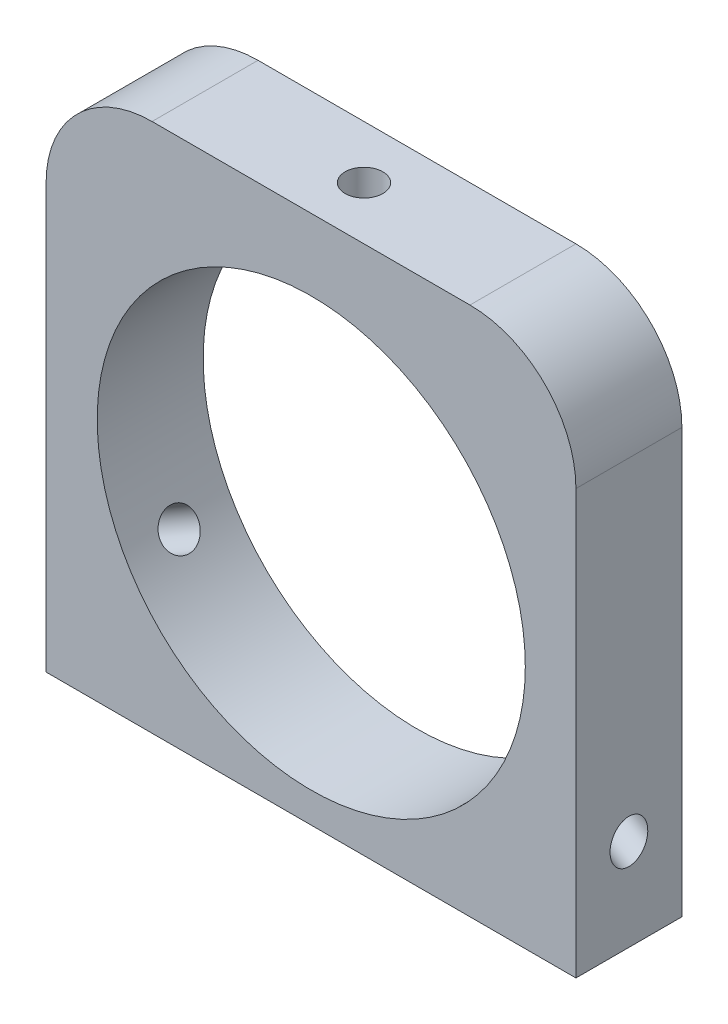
ISO-10303-21;
HEADER;
FILE_DESCRIPTION(('STEP AP214'),'2;1');
FILE_NAME('part.step','',(''),(''),'','','');
FILE_SCHEMA(('AUTOMOTIVE_DESIGN { 1 0 10303 214 1 1 1 1 }'));
ENDSEC;
DATA;
#1=APPLICATION_CONTEXT('core data for automotive mechanical design processes');
#2=APPLICATION_PROTOCOL_DEFINITION('international standard','automotive_design',2000,#1);
#3=PRODUCT_CONTEXT('',#1,'mechanical');
#4=PRODUCT('Part','Part','',(#3));
#5=PRODUCT_RELATED_PRODUCT_CATEGORY('part','',(#4));
#6=PRODUCT_DEFINITION_FORMATION('','',#4);
#7=PRODUCT_DEFINITION_CONTEXT('part definition',#1,'design');
#8=PRODUCT_DEFINITION('design','',#6,#7);
#9=PRODUCT_DEFINITION_SHAPE('','',#8);
#10=(LENGTH_UNIT() NAMED_UNIT(*) SI_UNIT(.MILLI.,.METRE.));
#11=(NAMED_UNIT(*) PLANE_ANGLE_UNIT() SI_UNIT($,.RADIAN.));
#12=(NAMED_UNIT(*) SI_UNIT($,.STERADIAN.) SOLID_ANGLE_UNIT());
#13=UNCERTAINTY_MEASURE_WITH_UNIT(LENGTH_MEASURE(1.E-05),#10,'distance_accuracy_value','');
#14=(GEOMETRIC_REPRESENTATION_CONTEXT(3) GLOBAL_UNCERTAINTY_ASSIGNED_CONTEXT((#13)) GLOBAL_UNIT_ASSIGNED_CONTEXT((#10,
#11,#12)) REPRESENTATION_CONTEXT('',''));
#15=CARTESIAN_POINT('',(0.,0.,0.));
#16=DIRECTION('',(0.,0.,1.));
#17=DIRECTION('',(1.,0.,0.));
#18=AXIS2_PLACEMENT_3D('',#15,#16,#17);
#19=CARTESIAN_POINT('',(15.875,31.75,-3.175));
#20=DIRECTION('',(-1.,0.,0.));
#21=DIRECTION('',(0.,0.,1.));
#22=AXIS2_PLACEMENT_3D('',#19,#20,#21);
#23=PLANE('',#22);
#24=CARTESIAN_POINT('',(15.875,5.49918608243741,0.));
#25=DIRECTION('',(-1.,0.,0.));
#26=DIRECTION('',(0.,-1.,0.));
#27=AXIS2_PLACEMENT_3D('',#24,#25,#26);
#28=ELLIPSE('',#27,1.30515801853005,1.13029999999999);
#29=CARTESIAN_POINT('',(15.875,4.19402806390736,0.));
#30=VERTEX_POINT('',#29);
#31=EDGE_CURVE('E465',#30,#30,#28,.T.);
#32=ORIENTED_EDGE('',*,*,#31,.T.);
#33=EDGE_LOOP('',(#32));
#34=FACE_BOUND('',#33,.T.);
#35=DIRECTION('',(0.,-1.,0.));
#36=VECTOR('',#35,1.);
#37=CARTESIAN_POINT('',(15.875,31.75,-3.175));
#38=LINE('',#37,#36);
#39=CARTESIAN_POINT('',(15.875,25.4,-3.175));
#40=VERTEX_POINT('',#39);
#41=CARTESIAN_POINT('',(15.875,0.,-3.175));
#42=VERTEX_POINT('',#41);
#43=EDGE_CURVE('E168',#40,#42,#38,.T.);
#44=ORIENTED_EDGE('',*,*,#43,.F.);
#45=DIRECTION('',(0.,0.,-1.));
#46=VECTOR('',#45,1.);
#47=CARTESIAN_POINT('',(15.875,25.4,3.175));
#48=LINE('',#47,#46);
#49=CARTESIAN_POINT('',(15.875,25.4,3.175));
#50=VERTEX_POINT('',#49);
#51=EDGE_CURVE('E11',#40,#50,#48,.F.);
#52=ORIENTED_EDGE('',*,*,#51,.T.);
#53=DIRECTION('',(0.,-1.,0.));
#54=VECTOR('',#53,1.);
#55=CARTESIAN_POINT('',(15.875,31.75,3.175));
#56=LINE('',#55,#54);
#57=CARTESIAN_POINT('',(15.875,0.,3.175));
#58=VERTEX_POINT('',#57);
#59=EDGE_CURVE('E145',#50,#58,#56,.T.);
#60=ORIENTED_EDGE('',*,*,#59,.T.);
#61=DIRECTION('',(0.,0.,-1.));
#62=VECTOR('',#61,1.);
#63=CARTESIAN_POINT('',(15.875,0.,-3.175));
#64=LINE('',#63,#62);
#65=EDGE_CURVE('E135',#58,#42,#64,.T.);
#66=ORIENTED_EDGE('',*,*,#65,.T.);
#67=EDGE_LOOP('',(#44,#52,#60,#66));
#68=FACE_BOUND('',#67,.T.);
#69=ADVANCED_FACE('F42',(#34,#68),#23,.F.);
#70=CARTESIAN_POINT('',(-15.875,31.75,-3.175));
#71=DIRECTION('',(0.,0.,1.));
#72=DIRECTION('',(1.,0.,0.));
#73=AXIS2_PLACEMENT_3D('',#70,#71,#72);
#74=PLANE('',#73);
#75=CARTESIAN_POINT('',(0.0144886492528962,14.6395265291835,-3.175));
#76=DIRECTION('',(0.,0.,1.));
#77=DIRECTION('',(1.,0.,0.));
#78=AXIS2_PLACEMENT_3D('',#75,#76,#77);
#79=CIRCLE('',#78,12.827);
#80=CARTESIAN_POINT('',(12.8414886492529,14.6395265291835,-3.175));
#81=VERTEX_POINT('',#80);
#82=EDGE_CURVE('E128',#81,#81,#79,.T.);
#83=ORIENTED_EDGE('',*,*,#82,.T.);
#84=EDGE_LOOP('',(#83));
#85=FACE_BOUND('',#84,.T.);
#86=DIRECTION('',(0.,-1.,0.));
#87=VECTOR('',#86,1.);
#88=CARTESIAN_POINT('',(-15.875,31.75,-3.175));
#89=LINE('',#88,#87);
#90=CARTESIAN_POINT('',(-15.875,25.4,-3.175));
#91=VERTEX_POINT('',#90);
#92=CARTESIAN_POINT('',(-15.875,0.,-3.175));
#93=VERTEX_POINT('',#92);
#94=EDGE_CURVE('E165',#91,#93,#89,.T.);
#95=ORIENTED_EDGE('',*,*,#94,.F.);
#96=CARTESIAN_POINT('',(-9.525,25.4,-3.175));
#97=DIRECTION('',(0.,0.,1.));
#98=DIRECTION('',(1.,0.,0.));
#99=AXIS2_PLACEMENT_3D('',#96,#97,#98);
#100=CIRCLE('',#99,6.35);
#101=CARTESIAN_POINT('',(-9.525,31.75,-3.175));
#102=VERTEX_POINT('',#101);
#103=EDGE_CURVE('E57',#91,#102,#100,.F.);
#104=ORIENTED_EDGE('',*,*,#103,.T.);
#105=DIRECTION('',(-1.,0.,0.));
#106=VECTOR('',#105,1.);
#107=CARTESIAN_POINT('',(-15.875,31.75,-3.175));
#108=LINE('',#107,#106);
#109=CARTESIAN_POINT('',(9.525,31.75,-3.175));
#110=VERTEX_POINT('',#109);
#111=EDGE_CURVE('E136',#110,#102,#108,.T.);
#112=ORIENTED_EDGE('',*,*,#111,.F.);
#113=CARTESIAN_POINT('',(9.525,25.4,-3.175));
#114=DIRECTION('',(0.,0.,1.));
#115=DIRECTION('',(1.,0.,0.));
#116=AXIS2_PLACEMENT_3D('',#113,#114,#115);
#117=CIRCLE('',#116,6.35);
#118=EDGE_CURVE('E65',#110,#40,#117,.F.);
#119=ORIENTED_EDGE('',*,*,#118,.T.);
#120=ORIENTED_EDGE('',*,*,#43,.T.);
#121=DIRECTION('',(-1.,0.,0.));
#122=VECTOR('',#121,1.);
#123=CARTESIAN_POINT('',(-15.875,0.,-3.175));
#124=LINE('',#123,#122);
#125=EDGE_CURVE('E149',#42,#93,#124,.T.);
#126=ORIENTED_EDGE('',*,*,#125,.T.);
#127=EDGE_LOOP('',(#95,#104,#112,#119,#120,#126));
#128=FACE_BOUND('',#127,.T.);
#129=ADVANCED_FACE('F225',(#85,#128),#74,.F.);
#130=CARTESIAN_POINT('',(-15.875,31.75,-3.175));
#131=DIRECTION('',(1.,0.,0.));
#132=DIRECTION('',(0.,0.,-1.));
#133=AXIS2_PLACEMENT_3D('',#130,#131,#132);
#134=PLANE('',#133);
#135=CARTESIAN_POINT('',(-15.875,5.44899592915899,0.));
#136=DIRECTION('',(1.,0.,0.));
#137=DIRECTION('',(0.,-1.,0.));
#138=AXIS2_PLACEMENT_3D('',#135,#136,#137);
#139=ELLIPSE('',#138,1.30515801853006,1.13029999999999);
#140=CARTESIAN_POINT('',(-15.875,4.14383791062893,0.));
#141=VERTEX_POINT('',#140);
#142=EDGE_CURVE('E199',#141,#141,#139,.T.);
#143=ORIENTED_EDGE('',*,*,#142,.T.);
#144=EDGE_LOOP('',(#143));
#145=FACE_BOUND('',#144,.T.);
#146=DIRECTION('',(0.,-1.,0.));
#147=VECTOR('',#146,1.);
#148=CARTESIAN_POINT('',(-15.875,31.75,3.175));
#149=LINE('',#148,#147);
#150=CARTESIAN_POINT('',(-15.875,25.4,3.175));
#151=VERTEX_POINT('',#150);
#152=CARTESIAN_POINT('',(-15.875,0.,3.175));
#153=VERTEX_POINT('',#152);
#154=EDGE_CURVE('E162',#151,#153,#149,.T.);
#155=ORIENTED_EDGE('',*,*,#154,.F.);
#156=DIRECTION('',(0.,0.,1.));
#157=VECTOR('',#156,1.);
#158=CARTESIAN_POINT('',(-15.875,25.4,-3.175));
#159=LINE('',#158,#157);
#160=EDGE_CURVE('E73',#151,#91,#159,.F.);
#161=ORIENTED_EDGE('',*,*,#160,.T.);
#162=ORIENTED_EDGE('',*,*,#94,.T.);
#163=DIRECTION('',(0.,0.,1.));
#164=VECTOR('',#163,1.);
#165=CARTESIAN_POINT('',(-15.875,0.,-3.175));
#166=LINE('',#165,#164);
#167=EDGE_CURVE('E153',#93,#153,#166,.T.);
#168=ORIENTED_EDGE('',*,*,#167,.T.);
#169=EDGE_LOOP('',(#155,#161,#162,#168));
#170=FACE_BOUND('',#169,.T.);
#171=ADVANCED_FACE('F231',(#145,#170),#134,.F.);
#172=CARTESIAN_POINT('',(-15.875,31.75,3.175));
#173=DIRECTION('',(0.,0.,-1.));
#174=DIRECTION('',(-1.,0.,0.));
#175=AXIS2_PLACEMENT_3D('',#172,#173,#174);
#176=PLANE('',#175);
#177=CARTESIAN_POINT('',(0.0144886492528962,14.6395265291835,3.175));
#178=DIRECTION('',(0.,0.,1.));
#179=DIRECTION('',(1.,0.,0.));
#180=AXIS2_PLACEMENT_3D('',#177,#178,#179);
#181=CIRCLE('',#180,12.827);
#182=CARTESIAN_POINT('',(12.8414886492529,14.6395265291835,3.175));
#183=VERTEX_POINT('',#182);
#184=EDGE_CURVE('E449',#183,#183,#181,.T.);
#185=ORIENTED_EDGE('',*,*,#184,.F.);
#186=EDGE_LOOP('',(#185));
#187=FACE_BOUND('',#186,.T.);
#188=DIRECTION('',(1.,0.,0.));
#189=VECTOR('',#188,1.);
#190=CARTESIAN_POINT('',(-15.875,31.75,3.175));
#191=LINE('',#190,#189);
#192=CARTESIAN_POINT('',(-9.525,31.75,3.175));
#193=VERTEX_POINT('',#192);
#194=CARTESIAN_POINT('',(9.525,31.75,3.175));
#195=VERTEX_POINT('',#194);
#196=EDGE_CURVE('E140',#193,#195,#191,.T.);
#197=ORIENTED_EDGE('',*,*,#196,.F.);
#198=CARTESIAN_POINT('',(-9.525,25.4,3.175));
#199=DIRECTION('',(0.,0.,-1.));
#200=DIRECTION('',(-1.,0.,0.));
#201=AXIS2_PLACEMENT_3D('',#198,#199,#200);
#202=CIRCLE('',#201,6.35);
#203=EDGE_CURVE('E182',#193,#151,#202,.F.);
#204=ORIENTED_EDGE('',*,*,#203,.T.);
#205=ORIENTED_EDGE('',*,*,#154,.T.);
#206=DIRECTION('',(1.,0.,0.));
#207=VECTOR('',#206,1.);
#208=CARTESIAN_POINT('',(-15.875,0.,3.175));
#209=LINE('',#208,#207);
#210=EDGE_CURVE('E141',#153,#58,#209,.T.);
#211=ORIENTED_EDGE('',*,*,#210,.T.);
#212=ORIENTED_EDGE('',*,*,#59,.F.);
#213=CARTESIAN_POINT('',(9.525,25.4,3.175));
#214=DIRECTION('',(0.,0.,-1.));
#215=DIRECTION('',(-1.,0.,0.));
#216=AXIS2_PLACEMENT_3D('',#213,#214,#215);
#217=CIRCLE('',#216,6.35);
#218=EDGE_CURVE('E179',#50,#195,#217,.F.);
#219=ORIENTED_EDGE('',*,*,#218,.T.);
#220=EDGE_LOOP('',(#197,#204,#205,#211,#212,#219));
#221=FACE_BOUND('',#220,.T.);
#222=ADVANCED_FACE('F256',(#187,#221),#176,.F.);
#223=CARTESIAN_POINT('',(0.,31.75,0.));
#224=DIRECTION('',(0.,1.,0.));
#225=DIRECTION('',(0.,0.,1.));
#226=AXIS2_PLACEMENT_3D('',#223,#224,#225);
#227=PLANE('',#226);
#228=CARTESIAN_POINT('',(0.,31.75,0.));
#229=DIRECTION('',(0.,1.,0.));
#230=DIRECTION('',(0.,0.,1.));
#231=AXIS2_PLACEMENT_3D('',#228,#229,#230);
#232=CIRCLE('',#231,1.13029999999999);
#233=CARTESIAN_POINT('',(0.,31.75,1.13029999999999));
#234=VERTEX_POINT('',#233);
#235=EDGE_CURVE('E198',#234,#234,#232,.T.);
#236=ORIENTED_EDGE('',*,*,#235,.F.);
#237=EDGE_LOOP('',(#236));
#238=FACE_BOUND('',#237,.T.);
#239=ORIENTED_EDGE('',*,*,#111,.T.);
#240=DIRECTION('',(0.,0.,1.));
#241=VECTOR('',#240,1.);
#242=CARTESIAN_POINT('',(-9.525,31.75,3.175));
#243=LINE('',#242,#241);
#244=EDGE_CURVE('E175',#102,#193,#243,.T.);
#245=ORIENTED_EDGE('',*,*,#244,.T.);
#246=ORIENTED_EDGE('',*,*,#196,.T.);
#247=DIRECTION('',(0.,0.,-1.));
#248=VECTOR('',#247,1.);
#249=CARTESIAN_POINT('',(9.525,31.75,-3.175));
#250=LINE('',#249,#248);
#251=EDGE_CURVE('E171',#195,#110,#250,.T.);
#252=ORIENTED_EDGE('',*,*,#251,.T.);
#253=EDGE_LOOP('',(#239,#245,#246,#252));
#254=FACE_BOUND('',#253,.T.);
#255=ADVANCED_FACE('F249',(#238,#254),#227,.T.);
#256=CARTESIAN_POINT('',(0.,0.,0.));
#257=DIRECTION('',(0.,1.,0.));
#258=DIRECTION('',(0.,0.,1.));
#259=AXIS2_PLACEMENT_3D('',#256,#257,#258);
#260=PLANE('',#259);
#261=CARTESIAN_POINT('',(-12.7,0.,0.));
#262=DIRECTION('',(0.,-1.,0.));
#263=DIRECTION('',(0.,0.,-1.));
#264=AXIS2_PLACEMENT_3D('',#261,#262,#263);
#265=CIRCLE('',#264,1.1303);
#266=CARTESIAN_POINT('',(-12.7,0.,-1.1303));
#267=VERTEX_POINT('',#266);
#268=EDGE_CURVE('E119',#267,#267,#265,.T.);
#269=ORIENTED_EDGE('',*,*,#268,.F.);
#270=EDGE_LOOP('',(#269));
#271=FACE_BOUND('',#270,.T.);
#272=CARTESIAN_POINT('',(12.7,0.,0.));
#273=DIRECTION('',(0.,-1.,0.));
#274=DIRECTION('',(0.,0.,-1.));
#275=AXIS2_PLACEMENT_3D('',#272,#273,#274);
#276=CIRCLE('',#275,1.1303);
#277=CARTESIAN_POINT('',(12.7,0.,-1.1303));
#278=VERTEX_POINT('',#277);
#279=EDGE_CURVE('E118',#278,#278,#276,.T.);
#280=ORIENTED_EDGE('',*,*,#279,.F.);
#281=EDGE_LOOP('',(#280));
#282=FACE_BOUND('',#281,.T.);
#283=ORIENTED_EDGE('',*,*,#65,.F.);
#284=ORIENTED_EDGE('',*,*,#210,.F.);
#285=ORIENTED_EDGE('',*,*,#167,.F.);
#286=ORIENTED_EDGE('',*,*,#125,.F.);
#287=EDGE_LOOP('',(#283,#284,#285,#286));
#288=FACE_BOUND('',#287,.T.);
#289=ADVANCED_FACE('F262',(#271,#282,#288),#260,.F.);
#290=CARTESIAN_POINT('',(12.7,4.826,0.));
#291=DIRECTION('',(0.,-1.,0.));
#292=DIRECTION('',(0.,0.,-1.));
#293=AXIS2_PLACEMENT_3D('',#290,#291,#292);
#294=CONICAL_SURFACE('',#293,1.1303,1.02974425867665);
#295=CARTESIAN_POINT('',(12.7,5.50515275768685,0.));
#296=VERTEX_POINT('',#295);
#297=VERTEX_LOOP('',#296);
#298=FACE_BOUND('',#297,.T.);
#299=CARTESIAN_POINT('',(12.7,4.826,0.));
#300=DIRECTION('',(0.,-1.,0.));
#301=DIRECTION('',(0.,0.,-1.));
#302=AXIS2_PLACEMENT_3D('',#299,#300,#301);
#303=CIRCLE('',#302,1.1303);
#304=CARTESIAN_POINT('',(12.7,4.826,-1.1303));
#305=VERTEX_POINT('',#304);
#306=EDGE_CURVE('E125',#305,#305,#303,.T.);
#307=ORIENTED_EDGE('',*,*,#306,.T.);
#308=EDGE_LOOP('',(#307));
#309=FACE_BOUND('',#308,.T.);
#310=ADVANCED_FACE('F274',(#298,#309),#294,.F.);
#311=CARTESIAN_POINT('',(12.7,0.,0.));
#312=DIRECTION('',(0.,-1.,0.));
#313=DIRECTION('',(0.,0.,-1.));
#314=AXIS2_PLACEMENT_3D('',#311,#312,#313);
#315=CYLINDRICAL_SURFACE('',#314,1.1303);
#316=ORIENTED_EDGE('',*,*,#306,.F.);
#317=EDGE_LOOP('',(#316));
#318=FACE_BOUND('',#317,.T.);
#319=ORIENTED_EDGE('',*,*,#279,.T.);
#320=EDGE_LOOP('',(#319));
#321=FACE_BOUND('',#320,.T.);
#322=ADVANCED_FACE('F111',(#318,#321),#315,.F.);
#323=CARTESIAN_POINT('',(-12.7,4.826,0.));
#324=DIRECTION('',(0.,-1.,0.));
#325=DIRECTION('',(0.,0.,-1.));
#326=AXIS2_PLACEMENT_3D('',#323,#324,#325);
#327=CONICAL_SURFACE('',#326,1.1303,1.02974425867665);
#328=CARTESIAN_POINT('',(-12.7,5.50515275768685,0.));
#329=VERTEX_POINT('',#328);
#330=VERTEX_LOOP('',#329);
#331=FACE_BOUND('',#330,.T.);
#332=CARTESIAN_POINT('',(-12.7,4.826,0.));
#333=DIRECTION('',(0.,-1.,0.));
#334=DIRECTION('',(0.,0.,-1.));
#335=AXIS2_PLACEMENT_3D('',#332,#333,#334);
#336=CIRCLE('',#335,1.1303);
#337=CARTESIAN_POINT('',(-12.7,4.826,-1.1303));
#338=VERTEX_POINT('',#337);
#339=EDGE_CURVE('E115',#338,#338,#336,.T.);
#340=ORIENTED_EDGE('',*,*,#339,.T.);
#341=EDGE_LOOP('',(#340));
#342=FACE_BOUND('',#341,.T.);
#343=ADVANCED_FACE('F107',(#331,#342),#327,.F.);
#344=CARTESIAN_POINT('',(-12.7,0.,0.));
#345=DIRECTION('',(0.,-1.,0.));
#346=DIRECTION('',(0.,0.,-1.));
#347=AXIS2_PLACEMENT_3D('',#344,#345,#346);
#348=CYLINDRICAL_SURFACE('',#347,1.1303);
#349=ORIENTED_EDGE('',*,*,#339,.F.);
#350=EDGE_LOOP('',(#349));
#351=FACE_BOUND('',#350,.T.);
#352=ORIENTED_EDGE('',*,*,#268,.T.);
#353=EDGE_LOOP('',(#352));
#354=FACE_BOUND('',#353,.T.);
#355=ADVANCED_FACE('F110',(#351,#354),#348,.F.);
#356=CARTESIAN_POINT('',(0.0144886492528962,14.6395265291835,-4.953));
#357=DIRECTION('',(0.,0.,1.));
#358=DIRECTION('',(1.,0.,0.));
#359=AXIS2_PLACEMENT_3D('',#356,#357,#358);
#360=CYLINDRICAL_SURFACE('',#359,12.827);
#361=CARTESIAN_POINT('',(11.65106125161,9.24303627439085,0.));
#362=CARTESIAN_POINT('',(11.6510604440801,9.24303355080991,0.0633529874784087));
#363=CARTESIAN_POINT('',(11.6488068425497,9.23816678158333,0.126748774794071));
#364=CARTESIAN_POINT('',(11.6398162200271,9.21884418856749,0.2517851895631));
#365=CARTESIAN_POINT('',(11.6330741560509,9.20437757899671,0.313423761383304));
#366=CARTESIAN_POINT('',(11.6152023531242,9.16633645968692,0.433116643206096));
#367=CARTESIAN_POINT('',(11.6040751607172,9.14276723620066,0.491173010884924));
#368=CARTESIAN_POINT('',(11.5775992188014,9.08728885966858,0.602088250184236));
#369=CARTESIAN_POINT('',(11.5622513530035,9.05538145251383,0.654948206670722));
#370=CARTESIAN_POINT('',(11.5275303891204,8.98414250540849,0.754137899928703));
#371=CARTESIAN_POINT('',(11.508146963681,8.94479194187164,0.800450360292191));
#372=CARTESIAN_POINT('',(11.4657165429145,8.85994575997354,0.88508205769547));
#373=CARTESIAN_POINT('',(11.4426693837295,8.81444986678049,0.923400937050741));
#374=CARTESIAN_POINT('',(11.3933177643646,8.7186244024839,0.99101793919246));
#375=CARTESIAN_POINT('',(11.3670078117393,8.66828671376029,1.02030055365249));
#376=CARTESIAN_POINT('',(11.3117368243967,8.56436623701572,1.06891508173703));
#377=CARTESIAN_POINT('',(11.2827758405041,8.51078351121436,1.08824718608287));
#378=CARTESIAN_POINT('',(11.2229856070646,8.40211046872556,1.11636287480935));
#379=CARTESIAN_POINT('',(11.1921614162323,8.34702443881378,1.12517378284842));
#380=CARTESIAN_POINT('',(11.1293995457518,8.23681575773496,1.13208089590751));
#381=CARTESIAN_POINT('',(11.0974618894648,8.18169310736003,1.1301773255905));
#382=CARTESIAN_POINT('',(11.0334891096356,8.07313350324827,1.11573192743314));
#383=CARTESIAN_POINT('',(11.0014545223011,8.0196921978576,1.10322039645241));
#384=CARTESIAN_POINT('',(10.9381833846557,7.91579807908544,1.06796081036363));
#385=CARTESIAN_POINT('',(10.906946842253,7.86534529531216,1.04521265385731));
#386=CARTESIAN_POINT('',(10.8462487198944,7.76870659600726,0.990095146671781));
#387=CARTESIAN_POINT('',(10.8167894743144,7.72252625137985,0.957713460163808));
#388=CARTESIAN_POINT('',(10.7606948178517,7.63569485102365,0.884256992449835));
#389=CARTESIAN_POINT('',(10.734059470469,7.59504391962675,0.843182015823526));
#390=CARTESIAN_POINT('',(10.6844767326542,7.52016481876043,0.753339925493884));
#391=CARTESIAN_POINT('',(10.66154208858,7.48595878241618,0.704547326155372));
#392=CARTESIAN_POINT('',(10.6203232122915,7.42498836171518,0.600743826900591));
#393=CARTESIAN_POINT('',(10.6020389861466,7.39822398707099,0.545732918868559));
#394=CARTESIAN_POINT('',(10.570821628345,7.3527901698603,0.431032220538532));
#395=CARTESIAN_POINT('',(10.5578896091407,7.33412241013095,0.371341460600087));
#396=CARTESIAN_POINT('',(10.5378953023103,7.30534960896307,0.248987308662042));
#397=CARTESIAN_POINT('',(10.5308328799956,7.29524437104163,0.186323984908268));
#398=CARTESIAN_POINT('',(10.5228759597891,7.28386380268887,0.0600226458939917));
#399=CARTESIAN_POINT('',(10.5219613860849,7.28255973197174,-0.00361151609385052));
#400=CARTESIAN_POINT('',(10.5262838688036,7.28873718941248,-0.130240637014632));
#401=CARTESIAN_POINT('',(10.5315208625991,7.2962186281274,-0.193235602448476));
#402=CARTESIAN_POINT('',(10.5479220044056,7.31976465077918,-0.316696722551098));
#403=CARTESIAN_POINT('',(10.5590767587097,7.3358156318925,-0.377166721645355));
#404=CARTESIAN_POINT('',(10.5868665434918,7.37610102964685,-0.493980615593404));
#405=CARTESIAN_POINT('',(10.6035016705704,7.40033559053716,-0.550324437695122));
#406=CARTESIAN_POINT('',(10.6416612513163,7.45647133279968,-0.657447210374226));
#407=CARTESIAN_POINT('',(10.6631982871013,7.48839225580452,-0.708211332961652));
#408=CARTESIAN_POINT('',(10.7103309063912,7.55908252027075,-0.802583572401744));
#409=CARTESIAN_POINT('',(10.7359265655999,7.59785198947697,-0.846191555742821));
#410=CARTESIAN_POINT('',(10.7903258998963,7.68138405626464,-0.925132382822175));
#411=CARTESIAN_POINT('',(10.8191380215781,7.7261624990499,-0.960442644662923));
#412=CARTESIAN_POINT('',(10.8789090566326,7.82047886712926,-1.02163035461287));
#413=CARTESIAN_POINT('',(10.9098679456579,7.87001673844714,-1.04750790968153));
#414=CARTESIAN_POINT('',(10.9728544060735,7.97246148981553,-1.08905491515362));
#415=CARTESIAN_POINT('',(11.004880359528,8.02536337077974,-1.10473914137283));
#416=CARTESIAN_POINT('',(11.0690319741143,8.13315024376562,-1.12550330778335));
#417=CARTESIAN_POINT('',(11.1011576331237,8.18803519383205,-1.13058347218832));
#418=CARTESIAN_POINT('',(11.1644506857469,8.29805273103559,-1.12999304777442));
#419=CARTESIAN_POINT('',(11.1956209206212,8.3531838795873,-1.12435829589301));
#420=CARTESIAN_POINT('',(11.2562658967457,8.46228844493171,-1.10257338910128));
#421=CARTESIAN_POINT('',(11.2857406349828,8.51626185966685,-1.08642321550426));
#422=CARTESIAN_POINT('',(11.3422625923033,8.62146742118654,-1.04407367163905));
#423=CARTESIAN_POINT('',(11.3693097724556,8.6726995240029,-1.01787414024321));
#424=CARTESIAN_POINT('',(11.4203708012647,8.77089399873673,-0.956173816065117));
#425=CARTESIAN_POINT('',(11.4443846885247,8.81785642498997,-0.920673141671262));
#426=CARTESIAN_POINT('',(11.4889729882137,8.90623771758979,-0.841239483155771));
#427=CARTESIAN_POINT('',(11.5095358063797,8.94763780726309,-0.797279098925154));
#428=CARTESIAN_POINT('',(11.5467590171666,9.02343737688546,-0.702225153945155));
#429=CARTESIAN_POINT('',(11.5634184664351,9.05783516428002,-0.6511298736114));
#430=CARTESIAN_POINT('',(11.5925856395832,9.11858995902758,-0.543147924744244));
#431=CARTESIAN_POINT('',(11.6050849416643,9.14493064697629,-0.486249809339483));
#432=CARTESIAN_POINT('',(11.6256861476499,9.18859908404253,-0.368398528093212));
#433=CARTESIAN_POINT('',(11.6337930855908,9.20593715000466,-0.307450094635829));
#434=CARTESIAN_POINT('',(11.6434488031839,9.22664464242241,-0.205121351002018));
#435=CARTESIAN_POINT('',(11.6463013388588,9.23278229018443,-0.164398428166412));
#436=CARTESIAN_POINT('',(11.6501078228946,9.24097898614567,-0.0824563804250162));
#437=CARTESIAN_POINT('',(11.6510617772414,9.24303804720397,-0.0412372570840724));
#438=CARTESIAN_POINT('',(11.65106125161,9.24303627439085,0.));
#439=B_SPLINE_CURVE_WITH_KNOTS('',3,(#361,#362,#363,#364,#365,#366,#367,#368,#369,#370,#371,
#372,#373,#374,#375,#376,#377,#378,#379,#380,#381,#382,#383,#384,#385,#386,#387,#388,#389,#390,
#391,#392,#393,#394,#395,#396,#397,#398,#399,#400,#401,#402,#403,#404,#405,#406,#407,#408,#409,
#410,#411,#412,#413,#414,#415,#416,#417,#418,#419,#420,#421,#422,#423,#424,#425,#426,#427,#428,
#429,#430,#431,#432,#433,#434,#435,#436,#437,#438),.UNSPECIFIED.,.T.,.F.,(4,2,2,2,2,2,2,2,2,2,2,
2,2,2,2,2,2,2,2,2,2,2,2,2,2,2,2,2,2,2,2,2,2,2,2,2,2,2,4),(0.,0.189908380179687,
0.380030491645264,0.570042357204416,0.760014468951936,0.950478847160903,1.14095174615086,
1.33174974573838,1.52254408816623,1.71284185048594,1.90313562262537,2.09288773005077,
2.28264171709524,2.47263973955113,2.66264203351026,2.85328539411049,3.04392900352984,
3.2346122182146,3.42529105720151,3.61534693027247,3.80540086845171,3.99515401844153,
4.18491051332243,4.37515967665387,4.56541238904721,4.75617702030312,4.94693948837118,
5.13742481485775,5.32790611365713,5.51775145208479,5.70759712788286,5.89744584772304,
6.0872921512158,6.2777640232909,6.46828188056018,6.65918310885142,6.84986508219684,
6.97347922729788,7.09709298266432),.UNSPECIFIED.);
#440=CARTESIAN_POINT('',(11.65106125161,9.24303627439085,0.));
#441=VERTEX_POINT('',#440);
#442=EDGE_CURVE('E46',#441,#441,#439,.T.);
#443=ORIENTED_EDGE('',*,*,#442,.T.);
#444=EDGE_LOOP('',(#443));
#445=FACE_BOUND('',#444,.T.);
#446=CARTESIAN_POINT('',(-10.4772953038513,7.26020416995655,0.));
#447=CARTESIAN_POINT('',(-10.4772972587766,7.26020623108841,0.0633529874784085));
#448=CARTESIAN_POINT('',(-10.480385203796,7.26459129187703,0.126748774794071));
#449=CARTESIAN_POINT('',(-10.4926237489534,7.28203869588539,0.2517851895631));
#450=CARTESIAN_POINT('',(-10.5017811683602,7.29511079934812,0.313423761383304));
#451=CARTESIAN_POINT('',(-10.5257898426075,7.32960879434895,0.433116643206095));
#452=CARTESIAN_POINT('',(-10.5406377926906,7.35102983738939,0.491173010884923));
#453=CARTESIAN_POINT('',(-10.5754455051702,7.4016978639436,0.602088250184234));
#454=CARTESIAN_POINT('',(-10.5954041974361,7.43094320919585,0.654948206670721));
#455=CARTESIAN_POINT('',(-10.6397384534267,7.49663191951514,0.754137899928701));
#456=CARTESIAN_POINT('',(-10.6641253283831,7.5330937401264,0.800450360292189));
#457=CARTESIAN_POINT('',(-10.7163890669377,7.61226265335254,0.885082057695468));
#458=CARTESIAN_POINT('',(-10.7442660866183,7.65497002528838,0.92340093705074));
#459=CARTESIAN_POINT('',(-10.8025775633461,7.74562251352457,0.99101793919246));
#460=CARTESIAN_POINT('',(-10.8330163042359,7.79357644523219,1.02030055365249));
#461=CARTESIAN_POINT('',(-10.8953785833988,7.89340276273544,1.06891508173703));
#462=CARTESIAN_POINT('',(-10.9273020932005,7.94527507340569,1.08824718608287));
#463=CARTESIAN_POINT('',(-10.9915205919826,8.05139145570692,1.11636287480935));
#464=CARTESIAN_POINT('',(-11.0238143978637,8.10562900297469,1.12517378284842));
#465=CARTESIAN_POINT('',(-11.0878769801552,8.21508671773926,1.13208089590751));
#466=CARTESIAN_POINT('',(-11.1196457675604,8.27030686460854,1.1301773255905));
#467=CARTESIAN_POINT('',(-11.1816747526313,8.37998871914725,1.11573192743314));
#468=CARTESIAN_POINT('',(-11.2119389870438,8.43445213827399,1.10322039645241));
#469=CARTESIAN_POINT('',(-11.2702783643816,8.54119361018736,1.06796081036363));
#470=CARTESIAN_POINT('',(-11.2983534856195,8.59347164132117,1.04521265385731));
#471=CARTESIAN_POINT('',(-11.351695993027,8.69435710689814,0.990095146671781));
#472=CARTESIAN_POINT('',(-11.3769597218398,8.74295973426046,0.957713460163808));
#473=CARTESIAN_POINT('',(-11.4241105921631,8.83495483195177,0.884256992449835));
#474=CARTESIAN_POINT('',(-11.445997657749,8.87834718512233,0.843182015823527));
#475=CARTESIAN_POINT('',(-11.4860534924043,8.95872664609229,0.753339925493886));
#476=CARTESIAN_POINT('',(-11.5042094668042,8.99569164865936,0.704547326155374));
#477=CARTESIAN_POINT('',(-11.5364019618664,9.06187345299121,0.600743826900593));
#478=CARTESIAN_POINT('',(-11.5504384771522,9.09109024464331,0.545732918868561));
#479=CARTESIAN_POINT('',(-11.5741766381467,9.1408421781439,0.431032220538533));
#480=CARTESIAN_POINT('',(-11.583877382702,9.1613755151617,0.371341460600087));
#481=CARTESIAN_POINT('',(-11.5987982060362,9.19307749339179,0.248987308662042));
#482=CARTESIAN_POINT('',(-11.6040183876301,9.20424634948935,0.186323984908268));
#483=CARTESIAN_POINT('',(-11.6098957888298,9.21682752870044,0.0600226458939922));
#484=CARTESIAN_POINT('',(-11.6105678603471,9.21827160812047,-0.00361151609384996));
#485=CARTESIAN_POINT('',(-11.607379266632,9.21143949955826,-0.130240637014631));
#486=CARTESIAN_POINT('',(-11.6035186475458,9.20316341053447,-0.193235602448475));
#487=CARTESIAN_POINT('',(-11.5913277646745,9.17718659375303,-0.316696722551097));
#488=CARTESIAN_POINT('',(-11.5830045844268,9.15950080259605,-0.377166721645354));
#489=CARTESIAN_POINT('',(-11.562011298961,9.11529144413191,-0.493980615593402));
#490=CARTESIAN_POINT('',(-11.5493411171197,9.08876772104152,-0.550324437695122));
#491=CARTESIAN_POINT('',(-11.519805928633,9.02765268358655,-0.657447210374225));
#492=CARTESIAN_POINT('',(-11.5029301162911,8.99304060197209,-0.708211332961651));
#493=CARTESIAN_POINT('',(-11.465276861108,8.91687742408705,-0.802583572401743));
#494=CARTESIAN_POINT('',(-11.4444993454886,8.87532619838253,-0.846191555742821));
#495=CARTESIAN_POINT('',(-11.399358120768,8.78644895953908,-0.925132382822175));
#496=CARTESIAN_POINT('',(-11.374984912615,8.7391077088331,-0.960442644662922));
#497=CARTESIAN_POINT('',(-11.3231900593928,8.64018629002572,-1.02163035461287));
#498=CARTESIAN_POINT('',(-11.2957684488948,8.58860616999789,-1.04750790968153));
#499=CARTESIAN_POINT('',(-11.2385419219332,8.48283591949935,-1.08905491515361));
#500=CARTESIAN_POINT('',(-11.2087405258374,8.42864968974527,-1.10473914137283));
#501=CARTESIAN_POINT('',(-11.1474701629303,8.31919932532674,-1.12550330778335));
#502=CARTESIAN_POINT('',(-11.116001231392,8.26393521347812,-1.13058347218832));
#503=CARTESIAN_POINT('',(-11.0523697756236,8.15411305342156,-1.12999304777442));
#504=CARTESIAN_POINT('',(-11.0202099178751,8.09955326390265,-1.12435829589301));
#505=CARTESIAN_POINT('',(-10.9560450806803,7.99248089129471,-1.10257338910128));
#506=CARTESIAN_POINT('',(-10.9240401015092,7.9399683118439,-1.08642321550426));
#507=CARTESIAN_POINT('',(-10.861190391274,7.83841608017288,-1.04407367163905));
#508=CARTESIAN_POINT('',(-10.8303456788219,7.78937648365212,-1.01787414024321));
#509=CARTESIAN_POINT('',(-10.7708372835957,7.69605909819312,-0.956173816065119));
#510=CARTESIAN_POINT('',(-10.742173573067,7.65178124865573,-0.920673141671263));
#511=CARTESIAN_POINT('',(-10.6879272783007,7.56897600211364,-0.841239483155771));
#512=CARTESIAN_POINT('',(-10.6623551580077,7.53046803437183,-0.797279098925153));
#513=CARTESIAN_POINT('',(-10.6153224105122,7.46033200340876,-0.702225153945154));
#514=CARTESIAN_POINT('',(-10.5938627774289,7.42870560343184,-0.6511298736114));
#515=CARTESIAN_POINT('',(-10.5558311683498,7.37306869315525,-0.543147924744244));
#516=CARTESIAN_POINT('',(-10.5392691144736,7.3490736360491,-0.486249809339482));
#517=CARTESIAN_POINT('',(-10.5117517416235,7.30939824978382,-0.368398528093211));
#518=CARTESIAN_POINT('',(-10.5007900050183,7.29370840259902,-0.307450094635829));
#519=CARTESIAN_POINT('',(-10.4876846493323,7.27499255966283,-0.205121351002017));
#520=CARTESIAN_POINT('',(-10.4837955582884,7.26945336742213,-0.164398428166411));
#521=CARTESIAN_POINT('',(-10.4786002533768,7.26205850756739,-0.0824563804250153));
#522=CARTESIAN_POINT('',(-10.4772940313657,7.26020282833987,-0.041237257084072));
#523=CARTESIAN_POINT('',(-10.4772953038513,7.26020416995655,0.));
#524=B_SPLINE_CURVE_WITH_KNOTS('',3,(#446,#447,#448,#449,#450,#451,#452,#453,#454,#455,#456,
#457,#458,#459,#460,#461,#462,#463,#464,#465,#466,#467,#468,#469,#470,#471,#472,#473,#474,#475,
#476,#477,#478,#479,#480,#481,#482,#483,#484,#485,#486,#487,#488,#489,#490,#491,#492,#493,#494,
#495,#496,#497,#498,#499,#500,#501,#502,#503,#504,#505,#506,#507,#508,#509,#510,#511,#512,#513,
#514,#515,#516,#517,#518,#519,#520,#521,#522,#523),.UNSPECIFIED.,.T.,.F.,(4,2,2,2,2,2,2,2,2,2,2,
2,2,2,2,2,2,2,2,2,2,2,2,2,2,2,2,2,2,2,2,2,2,2,2,2,2,2,4),(0.,0.189908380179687,
0.380030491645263,0.570042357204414,0.760014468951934,0.950478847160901,1.14095174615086,
1.33174974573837,1.52254408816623,1.71284185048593,1.90313562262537,2.09288773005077,
2.28264171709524,2.47263973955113,2.66264203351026,2.85328539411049,3.04392900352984,
3.2346122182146,3.42529105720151,3.61534693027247,3.80540086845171,3.99515401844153,
4.18491051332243,4.37515967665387,4.56541238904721,4.75617702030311,4.94693948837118,
5.13742481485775,5.32790611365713,5.5177514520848,5.70759712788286,5.89744584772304,
6.08729215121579,6.2777640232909,6.46828188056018,6.65918310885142,6.84986508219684,
6.97347922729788,7.09709298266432),.UNSPECIFIED.);
#525=CARTESIAN_POINT('',(-10.4772953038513,7.26020416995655,0.));
#526=VERTEX_POINT('',#525);
#527=EDGE_CURVE('E200',#526,#526,#524,.T.);
#528=ORIENTED_EDGE('',*,*,#527,.T.);
#529=EDGE_LOOP('',(#528));
#530=FACE_BOUND('',#529,.T.);
#531=CARTESIAN_POINT('',(0.,27.466518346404,1.13029999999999));
#532=CARTESIAN_POINT('',(0.0633537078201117,27.4665892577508,1.13029723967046));
#533=CARTESIAN_POINT('',(0.126750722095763,27.4661871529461,1.1249555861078));
#534=CARTESIAN_POINT('',(0.251790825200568,27.4644841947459,1.10372534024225));
#535=CARTESIAN_POINT('',(0.313431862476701,27.4631823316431,1.08782489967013));
#536=CARTESIAN_POINT('',(0.433130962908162,27.4598327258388,1.04594085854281));
#537=CARTESIAN_POINT('',(0.49119105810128,27.4577854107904,1.01996303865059));
#538=CARTESIAN_POINT('',(0.602113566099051,27.4531798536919,0.958672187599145));
#539=CARTESIAN_POINT('',(0.654977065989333,27.450621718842,0.92336111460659));
#540=CARTESIAN_POINT('',(0.754166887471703,27.4452784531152,0.844299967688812));
#541=CARTESIAN_POINT('',(0.800476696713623,27.4424927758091,0.800529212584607));
#542=CARTESIAN_POINT('',(0.885103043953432,27.4370170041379,0.705835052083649));
#543=CARTESIAN_POINT('',(0.923419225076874,27.4343269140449,0.6549113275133));
#544=CARTESIAN_POINT('',(0.991029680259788,27.4293448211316,0.547252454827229));
#545=CARTESIAN_POINT('',(1.02030876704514,27.4270534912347,0.490507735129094));
#546=CARTESIAN_POINT('',(1.06891751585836,27.423137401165,0.372884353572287));
#547=CARTESIAN_POINT('',(1.08824736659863,27.4215126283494,0.312005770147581));
#548=CARTESIAN_POINT('',(1.11636167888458,27.4191198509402,0.188005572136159));
#549=CARTESIAN_POINT('',(1.12517262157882,27.4183496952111,0.124890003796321));
#550=CARTESIAN_POINT('',(1.13208076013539,27.4177474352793,-0.00192850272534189));
#551=CARTESIAN_POINT('',(1.1301781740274,27.4179153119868,-0.0656314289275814));
#552=CARTESIAN_POINT('',(1.11573543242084,27.4191679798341,-0.191631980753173));
#553=CARTESIAN_POINT('',(1.10322450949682,27.4202502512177,-0.253932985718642));
#554=CARTESIAN_POINT('',(1.06796563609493,27.4232046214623,-0.375547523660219));
#555=CARTESIAN_POINT('',(1.04521757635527,27.4250767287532,-0.43486102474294));
#556=CARTESIAN_POINT('',(0.990097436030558,27.4294005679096,-0.548909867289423));
#557=CARTESIAN_POINT('',(0.957712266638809,27.4318530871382,-0.603638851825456));
#558=CARTESIAN_POINT('',(0.884246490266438,27.4370576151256,-0.706895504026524));
#559=CARTESIAN_POINT('',(0.843165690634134,27.439809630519,-0.755423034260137));
#560=CARTESIAN_POINT('',(0.753311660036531,27.4453102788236,-0.845068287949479));
#561=CARTESIAN_POINT('',(0.704513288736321,27.4480588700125,-0.886160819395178));
#562=CARTESIAN_POINT('',(0.600696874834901,27.453229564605,-0.959574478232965));
#563=CARTESIAN_POINT('',(0.545678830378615,27.4556516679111,-0.991895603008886));
#564=CARTESIAN_POINT('',(0.430972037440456,27.4598916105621,-1.04684553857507));
#565=CARTESIAN_POINT('',(0.371283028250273,27.4617094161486,-1.0694738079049));
#566=CARTESIAN_POINT('',(0.248933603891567,27.4645296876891,-1.10438076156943));
#567=CARTESIAN_POINT('',(0.186273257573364,27.4655321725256,-1.11665968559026));
#568=CARTESIAN_POINT('',(0.0599828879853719,27.4666007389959,-1.13048746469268));
#569=CARTESIAN_POINT('',(-0.00364322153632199,27.4666699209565,-1.13207183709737));
#570=CARTESIAN_POINT('',(-0.130255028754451,27.4658660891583,-1.12455919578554));
#571=CARTESIAN_POINT('',(-0.193240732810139,27.4649930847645,-1.11546228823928));
#572=CARTESIAN_POINT('',(-0.316687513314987,27.4623990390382,-1.08687409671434));
#573=CARTESIAN_POINT('',(-0.377152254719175,27.4606792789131,-1.06739851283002));
#574=CARTESIAN_POINT('',(-0.493955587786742,27.4565789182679,-1.01862245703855));
#575=CARTESIAN_POINT('',(-0.550294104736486,27.4541983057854,-0.989321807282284));
#576=CARTESIAN_POINT('',(-0.657412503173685,27.4490294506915,-0.921635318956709));
#577=CARTESIAN_POINT('',(-0.708176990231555,27.4462401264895,-0.88322520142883));
#578=CARTESIAN_POINT('',(-0.802550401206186,27.4405661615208,-0.798445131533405));
#579=CARTESIAN_POINT('',(-0.8461591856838,27.4376815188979,-0.752075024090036));
#580=CARTESIAN_POINT('',(-0.925105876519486,27.432128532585,-0.652536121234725));
#581=CARTESIAN_POINT('',(-0.960420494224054,27.4294608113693,-0.599348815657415));
#582=CARTESIAN_POINT('',(-1.02161625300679,27.4246492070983,-0.487777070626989));
#583=CARTESIAN_POINT('',(-1.04749750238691,27.4225053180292,-0.429392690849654));
#584=CARTESIAN_POINT('',(-1.08905009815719,27.4189853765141,-0.30917126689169));
#585=CARTESIAN_POINT('',(-1.10473647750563,27.4176081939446,-0.24733945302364));
#586=CARTESIAN_POINT('',(-1.12550332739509,27.4157723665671,-0.12190676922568));
#587=CARTESIAN_POINT('',(-1.13058403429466,27.415313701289,-0.058305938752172));
#588=CARTESIAN_POINT('',(-1.12999243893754,27.4153666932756,0.0686218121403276));
#589=CARTESIAN_POINT('',(-1.12435769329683,27.4158749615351,0.131948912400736));
#590=CARTESIAN_POINT('',(-1.10257357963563,27.4177978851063,0.256753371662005));
#591=CARTESIAN_POINT('',(-1.08642419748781,27.4192125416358,0.318230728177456));
#592=CARTESIAN_POINT('',(-1.04407903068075,27.4227894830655,0.437592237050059));
#593=CARTESIAN_POINT('',(-1.01788404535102,27.4249517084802,0.495476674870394));
#594=CARTESIAN_POINT('',(-0.956195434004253,27.4297827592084,0.606032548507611));
#595=CARTESIAN_POINT('',(-0.920701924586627,27.4324515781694,0.658704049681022));
#596=CARTESIAN_POINT('',(-0.841282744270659,27.4380096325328,0.757531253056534));
#597=CARTESIAN_POINT('',(-0.797329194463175,27.4408995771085,0.803664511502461));
#598=CARTESIAN_POINT('',(-0.702290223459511,27.4465721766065,0.887918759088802));
#599=CARTESIAN_POINT('',(-0.651203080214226,27.4493548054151,0.926037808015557));
#600=CARTESIAN_POINT('',(-0.543232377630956,27.4545100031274,0.993242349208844));
#601=CARTESIAN_POINT('',(-0.486336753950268,27.4568816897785,1.02230850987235));
#602=CARTESIAN_POINT('',(-0.368489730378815,27.4609429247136,1.07043706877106));
#603=CARTESIAN_POINT('',(-0.307543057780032,27.4626332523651,1.08951090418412));
#604=CARTESIAN_POINT('',(-0.205200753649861,27.464708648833,1.11228414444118));
#605=CARTESIAN_POINT('',(-0.1644625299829,27.4653436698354,1.11903100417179));
#606=CARTESIAN_POINT('',(-0.0824889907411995,27.466225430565,1.12803982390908));
#607=CARTESIAN_POINT('',(-0.0412536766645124,27.4664721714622,1.13030179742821));
#608=CARTESIAN_POINT('',(0.,27.466518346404,1.13029999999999));
#609=B_SPLINE_CURVE_WITH_KNOTS('',3,(#531,#532,#533,#534,#535,#536,#537,#538,#539,#540,#541,
#542,#543,#544,#545,#546,#547,#548,#549,#550,#551,#552,#553,#554,#555,#556,#557,#558,#559,#560,
#561,#562,#563,#564,#565,#566,#567,#568,#569,#570,#571,#572,#573,#574,#575,#576,#577,#578,#579,
#580,#581,#582,#583,#584,#585,#586,#587,#588,#589,#590,#591,#592,#593,#594,#595,#596,#597,#598,
#599,#600,#601,#602,#603,#604,#605,#606,#607,#608),.UNSPECIFIED.,.T.,.F.,(4,2,2,2,2,2,2,2,2,2,2,
2,2,2,2,2,2,2,2,2,2,2,2,2,2,2,2,2,2,2,2,2,2,2,2,2,2,2,4),(0.,0.189910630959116,
0.380034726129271,0.570049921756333,0.760025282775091,0.950471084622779,1.14092538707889,
1.33169803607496,1.52246706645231,1.71275481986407,1.90303870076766,2.09279992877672,
2.28256318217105,2.47258535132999,2.66261173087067,2.85327038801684,3.04392910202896,
3.23459846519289,3.42526341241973,3.61529483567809,3.80532437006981,3.99506725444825,
4.18481357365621,4.37507141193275,4.56533295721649,4.75612250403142,4.94690986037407,
5.13741524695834,5.32791638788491,5.51775107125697,5.70758600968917,5.89740584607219,
6.08722330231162,6.27767733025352,6.46817741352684,6.6590815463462,6.84976669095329,
6.97343009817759,7.09709313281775),.UNSPECIFIED.);
#610=CARTESIAN_POINT('',(0.,27.466518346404,1.13029999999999));
#611=VERTEX_POINT('',#610);
#612=EDGE_CURVE('E191',#611,#611,#609,.T.);
#613=ORIENTED_EDGE('',*,*,#612,.T.);
#614=EDGE_LOOP('',(#613));
#615=FACE_BOUND('',#614,.T.);
#616=ORIENTED_EDGE('',*,*,#184,.T.);
#617=EDGE_LOOP('',(#616));
#618=FACE_BOUND('',#617,.T.);
#619=ORIENTED_EDGE('',*,*,#82,.F.);
#620=EDGE_LOOP('',(#619));
#621=FACE_BOUND('',#620,.T.);
#622=ADVANCED_FACE('F205',(#445,#530,#615,#618,#621),#360,.F.);
#623=CARTESIAN_POINT('',(-9.525,25.4,0.));
#624=DIRECTION('',(0.,0.,-1.));
#625=DIRECTION('',(-1.,0.,0.));
#626=AXIS2_PLACEMENT_3D('',#623,#624,#625);
#627=CYLINDRICAL_SURFACE('',#626,6.35);
#628=ORIENTED_EDGE('',*,*,#103,.F.);
#629=ORIENTED_EDGE('',*,*,#160,.F.);
#630=ORIENTED_EDGE('',*,*,#203,.F.);
#631=ORIENTED_EDGE('',*,*,#244,.F.);
#632=EDGE_LOOP('',(#628,#629,#630,#631));
#633=FACE_BOUND('',#632,.T.);
#634=ADVANCED_FACE('F237',(#633),#627,.T.);
#635=CARTESIAN_POINT('',(9.525,25.4,0.));
#636=DIRECTION('',(0.,0.,1.));
#637=DIRECTION('',(1.,0.,0.));
#638=AXIS2_PLACEMENT_3D('',#635,#636,#637);
#639=CYLINDRICAL_SURFACE('',#638,6.35);
#640=ORIENTED_EDGE('',*,*,#218,.F.);
#641=ORIENTED_EDGE('',*,*,#51,.F.);
#642=ORIENTED_EDGE('',*,*,#118,.F.);
#643=ORIENTED_EDGE('',*,*,#251,.F.);
#644=EDGE_LOOP('',(#640,#641,#642,#643));
#645=FACE_BOUND('',#644,.T.);
#646=ADVANCED_FACE('F44',(#645),#639,.T.);
#647=CARTESIAN_POINT('',(0.,34.29,0.));
#648=DIRECTION('',(0.,1.,0.));
#649=DIRECTION('',(0.,0.,1.));
#650=AXIS2_PLACEMENT_3D('',#647,#648,#649);
#651=CYLINDRICAL_SURFACE('',#650,1.13029999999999);
#652=ORIENTED_EDGE('',*,*,#235,.T.);
#653=EDGE_LOOP('',(#652));
#654=FACE_BOUND('',#653,.T.);
#655=ORIENTED_EDGE('',*,*,#612,.F.);
#656=EDGE_LOOP('',(#655));
#657=FACE_BOUND('',#656,.T.);
#658=ADVANCED_FACE('F208',(#654,#657),#651,.F.);
#659=CARTESIAN_POINT('',(-16.9960762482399,4.80174225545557,0.));
#660=DIRECTION('',(-0.866025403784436,-0.500000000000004,0.));
#661=DIRECTION('',(0.500000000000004,-0.866025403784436,0.));
#662=AXIS2_PLACEMENT_3D('',#659,#660,#661);
#663=CYLINDRICAL_SURFACE('',#662,1.13029999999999);
#664=ORIENTED_EDGE('',*,*,#527,.F.);
#665=EDGE_LOOP('',(#664));
#666=FACE_BOUND('',#665,.T.);
#667=ORIENTED_EDGE('',*,*,#142,.F.);
#668=EDGE_LOOP('',(#667));
#669=FACE_BOUND('',#668,.T.);
#670=ADVANCED_FACE('F211',(#666,#669),#663,.F.);
#671=CARTESIAN_POINT('',(17.0395421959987,4.82683733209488,0.));
#672=DIRECTION('',(0.866025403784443,-0.499999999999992,0.));
#673=DIRECTION('',(0.499999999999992,0.866025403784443,0.));
#674=AXIS2_PLACEMENT_3D('',#671,#672,#673);
#675=CYLINDRICAL_SURFACE('',#674,1.13029999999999);
#676=ORIENTED_EDGE('',*,*,#442,.F.);
#677=EDGE_LOOP('',(#676));
#678=FACE_BOUND('',#677,.T.);
#679=ORIENTED_EDGE('',*,*,#31,.F.);
#680=EDGE_LOOP('',(#679));
#681=FACE_BOUND('',#680,.T.);
#682=ADVANCED_FACE('F215',(#678,#681),#675,.F.);
#683=CLOSED_SHELL('',(#69,#129,#171,#222,#255,#289,#310,#322,#343,#355,#622,#634,#646,#658,#670,#682));
#684=MANIFOLD_SOLID_BREP('B2',#683);
#685=ADVANCED_BREP_SHAPE_REPRESENTATION('',(#18,#684),#14);
#686=SHAPE_DEFINITION_REPRESENTATION(#9,#685);
ENDSEC;
END-ISO-10303-21;
